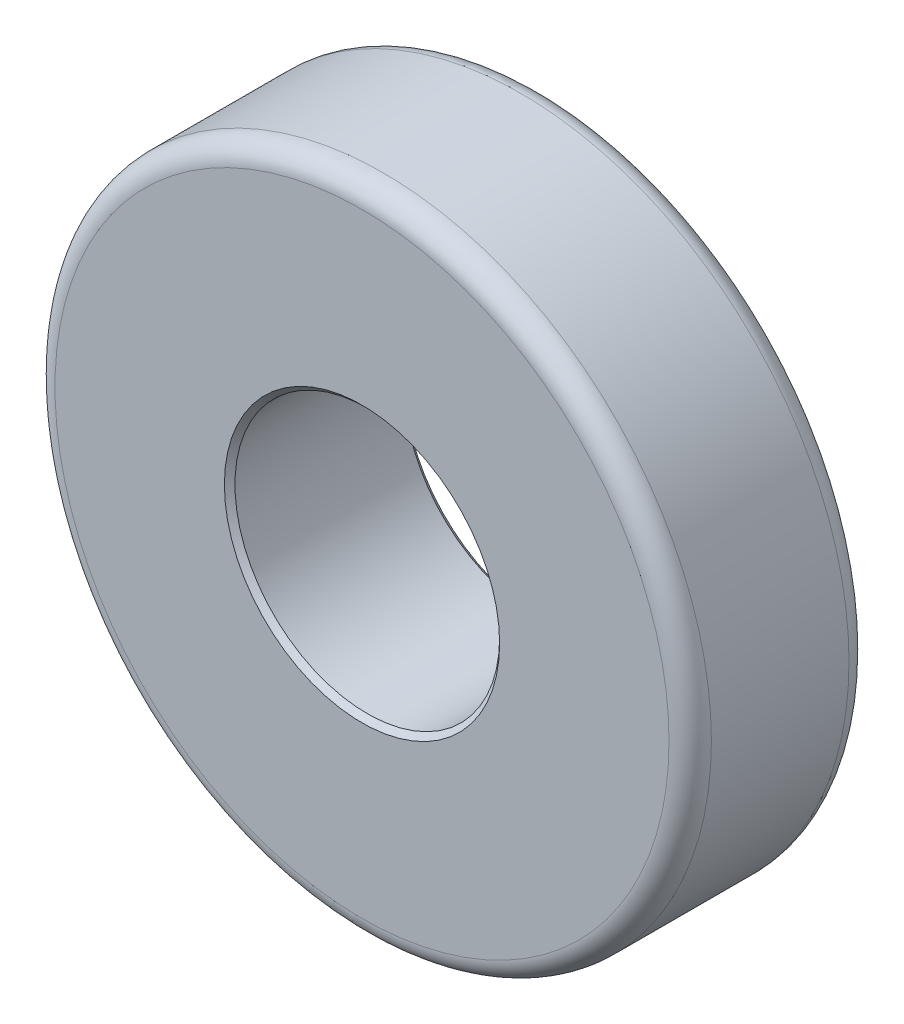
from build123d import *

# Parameters (mm, degrees)
SKETCH1_R      = 31
SKETCH1_R_2    = 12.5
EXTRUDE1_DEPTH = 17
FILLET1_R      = 2
CHAMFER1_SIZE  = 0.5


with BuildPart() as part:
    # Sketch1 → Extrude1 (new body)
    with BuildSketch(Plane.XY):
        Circle(SKETCH1_R)
        Circle(SKETCH1_R_2, mode=Mode.SUBTRACT)
    extrude(amount=EXTRUDE1_DEPTH)

    # Fillet1
    fillet1_edges = [part.edges().sort_by_distance(p)[0] for p in [
        (-31, 0, 0),
        (-31, 0, 17),
    ]]
    fillet(fillet1_edges, radius=FILLET1_R)

    # Chamfer1
    chamfer1_edges = [part.edges().sort_by_distance(p)[0] for p in [
        (-12.5, 0, 0),
        (-12.5, 0, 17),
    ]]
    chamfer(chamfer1_edges, length=CHAMFER1_SIZE)


solid = part.part
